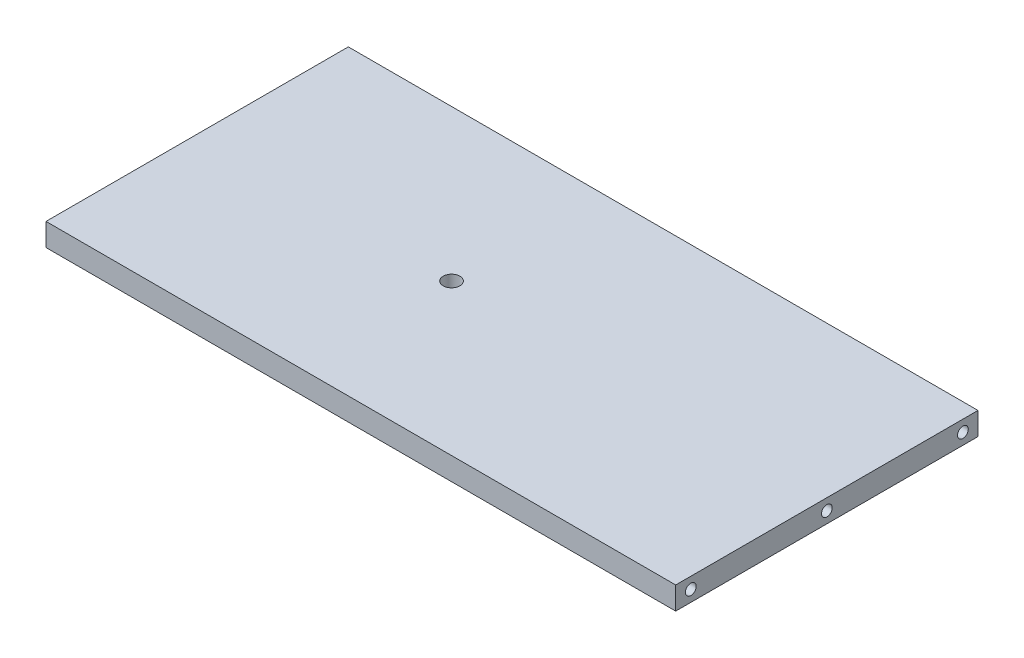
from build123d import *

# Parameters (mm, degrees)
SKETCH1_W           = 132.2705
SKETCH1_H           = 63.5
BOSS_EXTRUDE1_DEPTH = 4.7625
SKETCH2_R           = 1.1303
CUT_EXTRUDE1_DEPTH  = 10.16
SKETCH3_R           = 1.75895
CUT_EXTRUDE2_DEPTH  = 74.516088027


with BuildPart() as part:
    # Sketch1 → Boss-Extrude1 (new body)
    with BuildSketch(Plane(origin=(0, 0, 0), x_dir=(1, 0, 0), z_dir=(0, 1, 0))):
        Rectangle(SKETCH1_W, SKETCH1_H)
    extrude(amount=BOSS_EXTRUDE1_DEPTH)

    # Sketch2 → Cut-Extrude1 (cut)
    with BuildSketch(Plane.ZY.offset(66.13525)):
        with Locations((-28.575, 2.38125)):
            Circle(SKETCH2_R)
        with Locations(Location((28.575, 2.38125, 0), (0, 0, 180))):
            Circle(SKETCH2_R)
        with Locations((0, 2.38125)):
            Circle(SKETCH2_R)
    cut_extrude1 = extrude(amount=-CUT_EXTRUDE1_DEPTH, mode=Mode.SUBTRACT)

    # Mirror1: Cut-Extrude1 across plane
    add(cut_extrude1.mirror(Plane(origin=(0, 0, 0), x_dir=(0, 0, 1), z_dir=(1, 0, 0))), mode=Mode.SUBTRACT)

    # Sketch3 → Cut-Extrude2 (cut, through all)
    with BuildSketch(Plane(origin=(0, 4.7625, 0), x_dir=(1, 0, 0), z_dir=(0, 1, 0))):
        with Locations(Location((-12.7, 0, 0), (0, 0, 270))):
            Circle(SKETCH3_R)
    extrude(amount=-CUT_EXTRUDE2_DEPTH, mode=Mode.SUBTRACT)


solid = part.part
